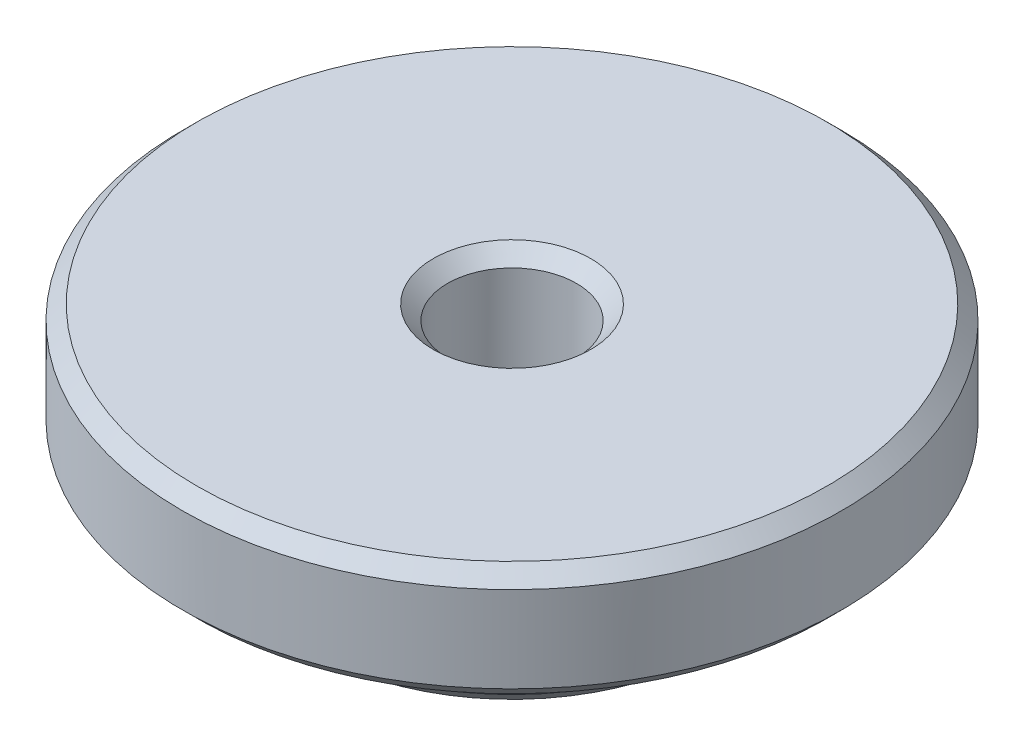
from build123d import *

# Parameters (mm, degrees)
ESQUISSE2_R             = 4.5
ENL_V_MAT_EXTRU_1_DEPTH = 36.411862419
CHANFREIN1_SIZE         = 1


with BuildPart() as part:
    # Esquisse1 → R_volution1 (revolve)
    with BuildSketch(Plane.XY, mode=Mode.PRIVATE) as r_volution1_sk:
        Polygon((0, 0), (15, 0), (15, 6), (23, 6), (23, 14), (0, 14), align=None)
    revolve(r_volution1_sk.sketch.rotate(Axis((0, 0, 0), (0, 1, 0)), 90), axis=Axis((0, 0, 0), (0, 1, 0)))

    # Esquisse2 → Enl_v. mat.-Extru.1 (cut, through all)
    with BuildSketch(Plane(origin=(0, 14, 0), x_dir=(1, 0, 0), z_dir=(0, 1, 0))):
        with Locations(Location((0, 0, 0), (0, 0, 270))):
            Circle(ESQUISSE2_R)
    extrude(amount=-ENL_V_MAT_EXTRU_1_DEPTH, mode=Mode.SUBTRACT)

    # Chanfrein1
    chanfrein1_edges = [part.edges().sort_by_distance(p)[0] for p in [
        (0, 0, -4.5),
        (0, 14, -4.5),
        (0, 14, 23),
        (0, 6, 23),
        (0, 0, 15),
    ]]
    chamfer(chanfrein1_edges, length=CHANFREIN1_SIZE)


solid = part.part
